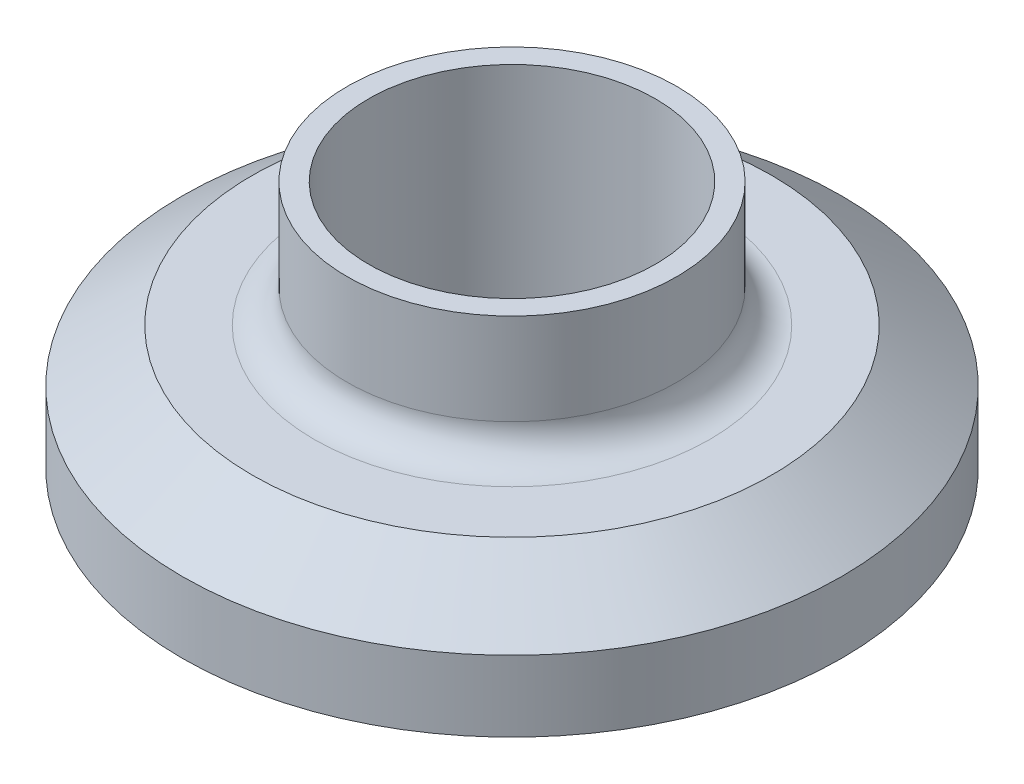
ISO-10303-21;
HEADER;
FILE_DESCRIPTION(('STEP AP214'),'2;1');
FILE_NAME('part.step','',(''),(''),'','','');
FILE_SCHEMA(('AUTOMOTIVE_DESIGN { 1 0 10303 214 1 1 1 1 }'));
ENDSEC;
DATA;
#1=APPLICATION_CONTEXT('core data for automotive mechanical design processes');
#2=APPLICATION_PROTOCOL_DEFINITION('international standard','automotive_design',2000,#1);
#3=PRODUCT_CONTEXT('',#1,'mechanical');
#4=PRODUCT('Part','Part','',(#3));
#5=PRODUCT_RELATED_PRODUCT_CATEGORY('part','',(#4));
#6=PRODUCT_DEFINITION_FORMATION('','',#4);
#7=PRODUCT_DEFINITION_CONTEXT('part definition',#1,'design');
#8=PRODUCT_DEFINITION('design','',#6,#7);
#9=PRODUCT_DEFINITION_SHAPE('','',#8);
#10=(LENGTH_UNIT() NAMED_UNIT(*) SI_UNIT(.MILLI.,.METRE.));
#11=(NAMED_UNIT(*) PLANE_ANGLE_UNIT() SI_UNIT($,.RADIAN.));
#12=(NAMED_UNIT(*) SI_UNIT($,.STERADIAN.) SOLID_ANGLE_UNIT());
#13=UNCERTAINTY_MEASURE_WITH_UNIT(LENGTH_MEASURE(1.E-05),#10,'distance_accuracy_value','');
#14=(GEOMETRIC_REPRESENTATION_CONTEXT(3) GLOBAL_UNCERTAINTY_ASSIGNED_CONTEXT((#13)) GLOBAL_UNIT_ASSIGNED_CONTEXT((#10,
#11,#12)) REPRESENTATION_CONTEXT('',''));
#15=CARTESIAN_POINT('',(0.,0.,0.));
#16=DIRECTION('',(0.,0.,1.));
#17=DIRECTION('',(1.,0.,0.));
#18=AXIS2_PLACEMENT_3D('',#15,#16,#17);
#19=CARTESIAN_POINT('',(0.,0.,0.));
#20=DIRECTION('',(0.,-1.,0.));
#21=DIRECTION('',(0.,0.,-1.));
#22=AXIS2_PLACEMENT_3D('',#19,#20,#21);
#23=CYLINDRICAL_SURFACE('',#22,25.4);
#24=CARTESIAN_POINT('',(0.,0.,0.));
#25=DIRECTION('',(0.,-1.,0.));
#26=DIRECTION('',(0.,0.,-1.));
#27=AXIS2_PLACEMENT_3D('',#24,#25,#26);
#28=CIRCLE('',#27,25.4);
#29=CARTESIAN_POINT('',(0.,0.,-25.4));
#30=VERTEX_POINT('',#29);
#31=EDGE_CURVE('E10',#30,#30,#28,.T.);
#32=ORIENTED_EDGE('',*,*,#31,.F.);
#33=EDGE_LOOP('',(#32));
#34=FACE_BOUND('',#33,.T.);
#35=CARTESIAN_POINT('',(0.,5.461,0.));
#36=DIRECTION('',(0.,-1.,0.));
#37=DIRECTION('',(0.,0.,-1.));
#38=AXIS2_PLACEMENT_3D('',#35,#36,#37);
#39=CIRCLE('',#38,25.4);
#40=CARTESIAN_POINT('',(0.,5.461,-25.4));
#41=VERTEX_POINT('',#40);
#42=EDGE_CURVE('E65',#41,#41,#39,.T.);
#43=ORIENTED_EDGE('',*,*,#42,.T.);
#44=EDGE_LOOP('',(#43));
#45=FACE_BOUND('',#44,.T.);
#46=ADVANCED_FACE('F31',(#34,#45),#23,.T.);
#47=CARTESIAN_POINT('',(-19.6128163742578,0.,0.));
#48=DIRECTION('',(0.,1.,0.));
#49=DIRECTION('',(0.,0.,1.));
#50=AXIS2_PLACEMENT_3D('',#47,#48,#49);
#51=PLANE('',#50);
#52=CARTESIAN_POINT('',(0.,0.,0.));
#53=DIRECTION('',(0.,-1.,0.));
#54=DIRECTION('',(0.,0.,-1.));
#55=AXIS2_PLACEMENT_3D('',#52,#53,#54);
#56=CIRCLE('',#55,19.6128163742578);
#57=CARTESIAN_POINT('',(0.,0.,-19.6128163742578));
#58=VERTEX_POINT('',#57);
#59=EDGE_CURVE('E37',#58,#58,#56,.T.);
#60=ORIENTED_EDGE('',*,*,#59,.F.);
#61=EDGE_LOOP('',(#60));
#62=FACE_BOUND('',#61,.T.);
#63=ORIENTED_EDGE('',*,*,#31,.T.);
#64=EDGE_LOOP('',(#63));
#65=FACE_BOUND('',#64,.T.);
#66=ADVANCED_FACE('F114',(#62,#65),#51,.F.);
#67=CARTESIAN_POINT('',(0.,-0.381000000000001,0.));
#68=DIRECTION('',(0.,-1.,0.));
#69=DIRECTION('',(0.,0.,-1.));
#70=AXIS2_PLACEMENT_3D('',#67,#68,#69);
#71=TOROIDAL_SURFACE('',#70,18.0848,1.5748);
#72=CARTESIAN_POINT('',(0.,0.,0.));
#73=DIRECTION('',(0.,-1.,0.));
#74=DIRECTION('',(0.,0.,-1.));
#75=AXIS2_PLACEMENT_3D('',#72,#73,#74);
#76=CIRCLE('',#75,16.5567836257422);
#77=CARTESIAN_POINT('',(0.,0.,-16.5567836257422));
#78=VERTEX_POINT('',#77);
#79=EDGE_CURVE('E41',#78,#78,#76,.T.);
#80=ORIENTED_EDGE('',*,*,#79,.F.);
#81=EDGE_LOOP('',(#80));
#82=FACE_BOUND('',#81,.T.);
#83=ORIENTED_EDGE('',*,*,#59,.T.);
#84=EDGE_LOOP('',(#83));
#85=FACE_BOUND('',#84,.T.);
#86=ADVANCED_FACE('F109',(#82,#85),#71,.F.);
#87=CARTESIAN_POINT('',(-11.049,0.,0.));
#88=DIRECTION('',(0.,1.,0.));
#89=DIRECTION('',(0.,0.,1.));
#90=AXIS2_PLACEMENT_3D('',#87,#88,#89);
#91=PLANE('',#90);
#92=CARTESIAN_POINT('',(0.,0.,0.));
#93=DIRECTION('',(0.,-1.,0.));
#94=DIRECTION('',(0.,0.,-1.));
#95=AXIS2_PLACEMENT_3D('',#92,#93,#94);
#96=CIRCLE('',#95,11.049);
#97=CARTESIAN_POINT('',(0.,0.,-11.049));
#98=VERTEX_POINT('',#97);
#99=EDGE_CURVE('E45',#98,#98,#96,.T.);
#100=ORIENTED_EDGE('',*,*,#99,.F.);
#101=EDGE_LOOP('',(#100));
#102=FACE_BOUND('',#101,.T.);
#103=ORIENTED_EDGE('',*,*,#79,.T.);
#104=EDGE_LOOP('',(#103));
#105=FACE_BOUND('',#104,.T.);
#106=ADVANCED_FACE('F103',(#102,#105),#91,.F.);
#107=CARTESIAN_POINT('',(0.,0.,0.));
#108=DIRECTION('',(0.,-1.,0.));
#109=DIRECTION('',(0.,0.,-1.));
#110=AXIS2_PLACEMENT_3D('',#107,#108,#109);
#111=CYLINDRICAL_SURFACE('',#110,11.049);
#112=CARTESIAN_POINT('',(0.,19.1138940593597,0.));
#113=DIRECTION('',(0.,-1.,0.));
#114=DIRECTION('',(0.,0.,-1.));
#115=AXIS2_PLACEMENT_3D('',#112,#113,#114);
#116=CIRCLE('',#115,11.049);
#117=CARTESIAN_POINT('',(0.,19.1138940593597,-11.049));
#118=VERTEX_POINT('',#117);
#119=EDGE_CURVE('E50',#118,#118,#116,.T.);
#120=ORIENTED_EDGE('',*,*,#119,.F.);
#121=EDGE_LOOP('',(#120));
#122=FACE_BOUND('',#121,.T.);
#123=ORIENTED_EDGE('',*,*,#99,.T.);
#124=EDGE_LOOP('',(#123));
#125=FACE_BOUND('',#124,.T.);
#126=ADVANCED_FACE('F97',(#122,#125),#111,.F.);
#127=CARTESIAN_POINT('',(-12.7,19.1138940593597,0.));
#128=DIRECTION('',(0.,-1.,0.));
#129=DIRECTION('',(0.,0.,-1.));
#130=AXIS2_PLACEMENT_3D('',#127,#128,#129);
#131=PLANE('',#130);
#132=CARTESIAN_POINT('',(0.,19.1138940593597,0.));
#133=DIRECTION('',(0.,-1.,0.));
#134=DIRECTION('',(0.,0.,-1.));
#135=AXIS2_PLACEMENT_3D('',#132,#133,#134);
#136=CIRCLE('',#135,12.7);
#137=CARTESIAN_POINT('',(0.,19.1138940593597,-12.7));
#138=VERTEX_POINT('',#137);
#139=EDGE_CURVE('E53',#138,#138,#136,.T.);
#140=ORIENTED_EDGE('',*,*,#139,.F.);
#141=EDGE_LOOP('',(#140));
#142=FACE_BOUND('',#141,.T.);
#143=ORIENTED_EDGE('',*,*,#119,.T.);
#144=EDGE_LOOP('',(#143));
#145=FACE_BOUND('',#144,.T.);
#146=ADVANCED_FACE('F91',(#142,#145),#131,.F.);
#147=CARTESIAN_POINT('',(0.,0.,0.));
#148=DIRECTION('',(0.,-1.,0.));
#149=DIRECTION('',(0.,0.,-1.));
#150=AXIS2_PLACEMENT_3D('',#147,#148,#149);
#151=CYLINDRICAL_SURFACE('',#150,12.7);
#152=CARTESIAN_POINT('',(0.,12.065,0.));
#153=DIRECTION('',(0.,-1.,0.));
#154=DIRECTION('',(0.,0.,-1.));
#155=AXIS2_PLACEMENT_3D('',#152,#153,#154);
#156=CIRCLE('',#155,12.7);
#157=CARTESIAN_POINT('',(0.,12.065,-12.7));
#158=VERTEX_POINT('',#157);
#159=EDGE_CURVE('E56',#158,#158,#156,.T.);
#160=ORIENTED_EDGE('',*,*,#159,.F.);
#161=EDGE_LOOP('',(#160));
#162=FACE_BOUND('',#161,.T.);
#163=ORIENTED_EDGE('',*,*,#139,.T.);
#164=EDGE_LOOP('',(#163));
#165=FACE_BOUND('',#164,.T.);
#166=ADVANCED_FACE('F85',(#162,#165),#151,.T.);
#167=CARTESIAN_POINT('',(0.,12.065,0.));
#168=DIRECTION('',(0.,-1.,0.));
#169=DIRECTION('',(0.,0.,-1.));
#170=AXIS2_PLACEMENT_3D('',#167,#168,#169);
#171=TOROIDAL_SURFACE('',#170,15.24,2.54);
#172=CARTESIAN_POINT('',(0.,9.525,0.));
#173=DIRECTION('',(0.,-1.,0.));
#174=DIRECTION('',(0.,0.,-1.));
#175=AXIS2_PLACEMENT_3D('',#172,#173,#174);
#176=CIRCLE('',#175,15.24);
#177=CARTESIAN_POINT('',(0.,9.525,-15.24));
#178=VERTEX_POINT('',#177);
#179=EDGE_CURVE('E59',#178,#178,#176,.T.);
#180=ORIENTED_EDGE('',*,*,#179,.F.);
#181=EDGE_LOOP('',(#180));
#182=FACE_BOUND('',#181,.T.);
#183=ORIENTED_EDGE('',*,*,#159,.T.);
#184=EDGE_LOOP('',(#183));
#185=FACE_BOUND('',#184,.T.);
#186=ADVANCED_FACE('F79',(#182,#185),#171,.F.);
#187=CARTESIAN_POINT('',(-15.24,9.525,0.));
#188=DIRECTION('',(0.,-1.,0.));
#189=DIRECTION('',(0.,0.,-1.));
#190=AXIS2_PLACEMENT_3D('',#187,#188,#189);
#191=PLANE('',#190);
#192=CARTESIAN_POINT('',(0.,9.525,0.));
#193=DIRECTION('',(0.,-1.,0.));
#194=DIRECTION('',(0.,0.,-1.));
#195=AXIS2_PLACEMENT_3D('',#192,#193,#194);
#196=CIRCLE('',#195,20.0068898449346);
#197=CARTESIAN_POINT('',(0.,9.525,-20.0068898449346));
#198=VERTEX_POINT('',#197);
#199=EDGE_CURVE('E62',#198,#198,#196,.T.);
#200=ORIENTED_EDGE('',*,*,#199,.F.);
#201=EDGE_LOOP('',(#200));
#202=FACE_BOUND('',#201,.T.);
#203=ORIENTED_EDGE('',*,*,#179,.T.);
#204=EDGE_LOOP('',(#203));
#205=FACE_BOUND('',#204,.T.);
#206=ADVANCED_FACE('F73',(#202,#205),#191,.F.);
#207=CARTESIAN_POINT('',(0.,9.525,0.));
#208=DIRECTION('',(0.,-1.,0.));
#209=DIRECTION('',(0.,0.,-1.));
#210=AXIS2_PLACEMENT_3D('',#207,#208,#209);
#211=CONICAL_SURFACE('',#210,20.0068898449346,0.925024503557);
#212=ORIENTED_EDGE('',*,*,#42,.F.);
#213=EDGE_LOOP('',(#212));
#214=FACE_BOUND('',#213,.T.);
#215=ORIENTED_EDGE('',*,*,#199,.T.);
#216=EDGE_LOOP('',(#215));
#217=FACE_BOUND('',#216,.T.);
#218=ADVANCED_FACE('F70',(#214,#217),#211,.T.);
#219=CLOSED_SHELL('',(#46,#66,#86,#106,#126,#146,#166,#186,#206,#218));
#220=MANIFOLD_SOLID_BREP('B2',#219);
#221=ADVANCED_BREP_SHAPE_REPRESENTATION('',(#18,#220),#14);
#222=SHAPE_DEFINITION_REPRESENTATION(#9,#221);
ENDSEC;
END-ISO-10303-21;
